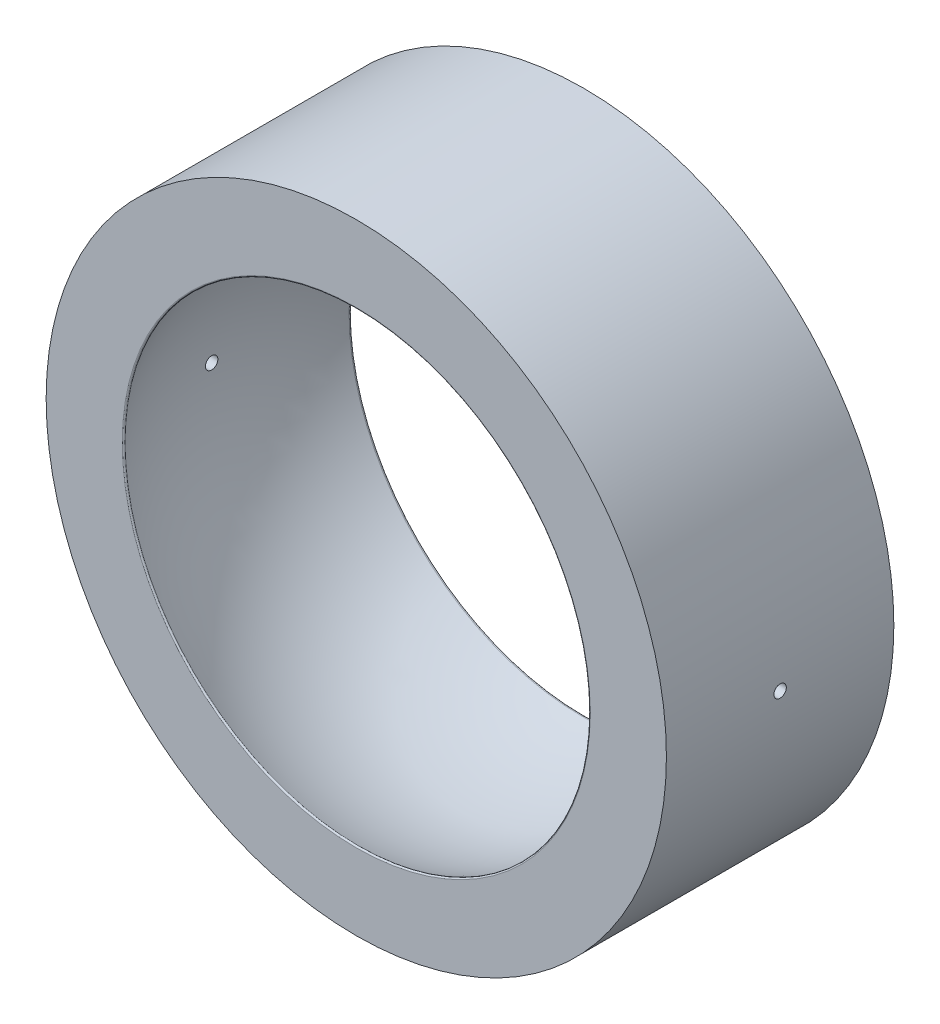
ISO-10303-21;
HEADER;
FILE_DESCRIPTION(('STEP AP214'),'2;1');
FILE_NAME('part.step','',(''),(''),'','','');
FILE_SCHEMA(('AUTOMOTIVE_DESIGN { 1 0 10303 214 1 1 1 1 }'));
ENDSEC;
DATA;
#1=APPLICATION_CONTEXT('core data for automotive mechanical design processes');
#2=APPLICATION_PROTOCOL_DEFINITION('international standard','automotive_design',2000,#1);
#3=PRODUCT_CONTEXT('',#1,'mechanical');
#4=PRODUCT('Part','Part','',(#3));
#5=PRODUCT_RELATED_PRODUCT_CATEGORY('part','',(#4));
#6=PRODUCT_DEFINITION_FORMATION('','',#4);
#7=PRODUCT_DEFINITION_CONTEXT('part definition',#1,'design');
#8=PRODUCT_DEFINITION('design','',#6,#7);
#9=PRODUCT_DEFINITION_SHAPE('','',#8);
#10=(LENGTH_UNIT() NAMED_UNIT(*) SI_UNIT(.MILLI.,.METRE.));
#11=(NAMED_UNIT(*) PLANE_ANGLE_UNIT() SI_UNIT($,.RADIAN.));
#12=(NAMED_UNIT(*) SI_UNIT($,.STERADIAN.) SOLID_ANGLE_UNIT());
#13=UNCERTAINTY_MEASURE_WITH_UNIT(LENGTH_MEASURE(1.E-05),#10,'distance_accuracy_value','');
#14=(GEOMETRIC_REPRESENTATION_CONTEXT(3) GLOBAL_UNCERTAINTY_ASSIGNED_CONTEXT((#13)) GLOBAL_UNIT_ASSIGNED_CONTEXT((#10,
#11,#12)) REPRESENTATION_CONTEXT('',''));
#15=CARTESIAN_POINT('',(0.,0.,0.));
#16=DIRECTION('',(0.,0.,1.));
#17=DIRECTION('',(1.,0.,0.));
#18=AXIS2_PLACEMENT_3D('',#15,#16,#17);
#19=CARTESIAN_POINT('',(69.,0.,0.));
#20=DIRECTION('',(0.,0.,-1.));
#21=DIRECTION('',(-1.,0.,0.));
#22=AXIS2_PLACEMENT_3D('',#19,#20,#21);
#23=DEGENERATE_TOROIDAL_SURFACE('',#22,0.0296511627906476,12.4703488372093,.T.);
#24=CARTESIAN_POINT('',(69.,0.,5.41395102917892));
#25=DIRECTION('',(0.,0.,-1.));
#26=DIRECTION('',(0.,1.,0.));
#27=AXIS2_PLACEMENT_3D('',#24,#25,#26);
#28=CIRCLE('',#27,11.2634721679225);
#29=CARTESIAN_POINT('',(69.,11.2634721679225,5.41395102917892));
#30=VERTEX_POINT('',#29);
#31=EDGE_CURVE('E34',#30,#30,#28,.T.);
#32=ORIENTED_EDGE('',*,*,#31,.F.);
#33=EDGE_LOOP('',(#32));
#34=FACE_BOUND('',#33,.T.);
#35=CARTESIAN_POINT('',(81.4963909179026,0.,-0.3));
#36=CARTESIAN_POINT('',(81.496390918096,0.0168414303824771,-0.299998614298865));
#37=CARTESIAN_POINT('',(81.496390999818,0.0336981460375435,-0.298576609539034));
#38=CARTESIAN_POINT('',(81.4963913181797,0.0669618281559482,-0.292919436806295));
#39=CARTESIAN_POINT('',(81.4963915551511,0.0833677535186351,-0.288678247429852));
#40=CARTESIAN_POINT('',(81.4963921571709,0.11522233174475,-0.277503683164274));
#41=CARTESIAN_POINT('',(81.4963925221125,0.130671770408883,-0.270572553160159));
#42=CARTESIAN_POINT('',(81.4963933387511,0.160179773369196,-0.254218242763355));
#43=CARTESIAN_POINT('',(81.4963937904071,0.174238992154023,-0.244796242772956));
#44=CARTESIAN_POINT('',(81.4963947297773,0.200579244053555,-0.223724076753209));
#45=CARTESIAN_POINT('',(81.4963952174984,0.212859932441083,-0.212073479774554));
#46=CARTESIAN_POINT('',(81.4963961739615,0.235292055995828,-0.186874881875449));
#47=CARTESIAN_POINT('',(81.4963966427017,0.245443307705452,-0.173326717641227));
#48=CARTESIAN_POINT('',(81.4963975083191,0.263326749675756,-0.144718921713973));
#49=CARTESIAN_POINT('',(81.496397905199,0.271059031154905,-0.129659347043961));
#50=CARTESIAN_POINT('',(81.4963985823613,0.283885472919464,-0.0984559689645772));
#51=CARTESIAN_POINT('',(81.4963988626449,0.288979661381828,-0.0823121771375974));
#52=CARTESIAN_POINT('',(81.4963992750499,0.296385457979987,-0.0493984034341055));
#53=CARTESIAN_POINT('',(81.4963994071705,0.298697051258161,-0.0326284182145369));
#54=CARTESIAN_POINT('',(81.4963995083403,0.300471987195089,0.00106161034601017));
#55=CARTESIAN_POINT('',(81.4963994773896,0.299935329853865,0.0179816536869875));
#56=CARTESIAN_POINT('',(81.4963992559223,0.296029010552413,0.0514913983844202));
#57=CARTESIAN_POINT('',(81.4963990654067,0.292659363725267,0.0680811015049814));
#58=CARTESIAN_POINT('',(81.4963985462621,0.283182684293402,0.10045950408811));
#59=CARTESIAN_POINT('',(81.4963982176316,0.277075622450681,0.116248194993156));
#60=CARTESIAN_POINT('',(81.4963974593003,0.262297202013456,0.146576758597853));
#61=CARTESIAN_POINT('',(81.4963970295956,0.253625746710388,0.161116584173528));
#62=CARTESIAN_POINT('',(81.4963961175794,0.233965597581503,0.188532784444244));
#63=CARTESIAN_POINT('',(81.4963956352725,0.222977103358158,0.201409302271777));
#64=CARTESIAN_POINT('',(81.4963946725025,0.1989968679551,0.225132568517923));
#65=CARTESIAN_POINT('',(81.4963941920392,0.186005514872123,0.235979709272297));
#66=CARTESIAN_POINT('',(81.4963932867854,0.158379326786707,0.255344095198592));
#67=CARTESIAN_POINT('',(81.4963928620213,0.1437437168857,0.263860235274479));
#68=CARTESIAN_POINT('',(81.4963921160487,0.113239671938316,0.278320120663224));
#69=CARTESIAN_POINT('',(81.4963917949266,0.0973702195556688,0.28426171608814));
#70=CARTESIAN_POINT('',(81.4963912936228,0.0648851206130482,0.293382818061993));
#71=CARTESIAN_POINT('',(81.496391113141,0.0482711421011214,0.296568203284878));
#72=CARTESIAN_POINT('',(81.4963909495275,0.0210523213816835,0.299446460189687));
#73=CARTESIAN_POINT('',(81.4963909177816,0.0105291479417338,0.300000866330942));
#74=CARTESIAN_POINT('',(81.496390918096,-0.0168414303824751,0.299998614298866));
#75=CARTESIAN_POINT('',(81.496390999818,-0.0336981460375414,0.298576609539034));
#76=CARTESIAN_POINT('',(81.4963913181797,-0.0669618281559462,0.292919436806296));
#77=CARTESIAN_POINT('',(81.4963915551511,-0.0833677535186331,0.288678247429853));
#78=CARTESIAN_POINT('',(81.4963921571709,-0.115222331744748,0.277503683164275));
#79=CARTESIAN_POINT('',(81.4963925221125,-0.130671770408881,0.270572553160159));
#80=CARTESIAN_POINT('',(81.4963933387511,-0.160179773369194,0.254218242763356));
#81=CARTESIAN_POINT('',(81.4963937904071,-0.174238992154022,0.244796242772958));
#82=CARTESIAN_POINT('',(81.4963947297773,-0.200579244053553,0.22372407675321));
#83=CARTESIAN_POINT('',(81.4963952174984,-0.212859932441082,0.212073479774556));
#84=CARTESIAN_POINT('',(81.4963961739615,-0.235292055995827,0.186874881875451));
#85=CARTESIAN_POINT('',(81.4963966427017,-0.245443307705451,0.173326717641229));
#86=CARTESIAN_POINT('',(81.4963975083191,-0.263326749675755,0.144718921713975));
#87=CARTESIAN_POINT('',(81.496397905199,-0.271059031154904,0.129659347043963));
#88=CARTESIAN_POINT('',(81.4963985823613,-0.283885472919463,0.0984559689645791));
#89=CARTESIAN_POINT('',(81.4963988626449,-0.288979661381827,0.0823121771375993));
#90=CARTESIAN_POINT('',(81.4963992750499,-0.296385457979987,0.0493984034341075));
#91=CARTESIAN_POINT('',(81.4963994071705,-0.298697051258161,0.0326284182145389));
#92=CARTESIAN_POINT('',(81.4963995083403,-0.300471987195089,-0.00106161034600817));
#93=CARTESIAN_POINT('',(81.4963994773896,-0.299935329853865,-0.0179816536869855));
#94=CARTESIAN_POINT('',(81.4963992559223,-0.296029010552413,-0.0514913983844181));
#95=CARTESIAN_POINT('',(81.4963990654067,-0.292659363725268,-0.0680811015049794));
#96=CARTESIAN_POINT('',(81.4963985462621,-0.283182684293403,-0.100459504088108));
#97=CARTESIAN_POINT('',(81.4963982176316,-0.277075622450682,-0.116248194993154));
#98=CARTESIAN_POINT('',(81.4963974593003,-0.262297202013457,-0.146576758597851));
#99=CARTESIAN_POINT('',(81.4963970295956,-0.253625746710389,-0.161116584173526));
#100=CARTESIAN_POINT('',(81.4963961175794,-0.233965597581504,-0.188532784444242));
#101=CARTESIAN_POINT('',(81.4963956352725,-0.22297710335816,-0.201409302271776));
#102=CARTESIAN_POINT('',(81.4963946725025,-0.198996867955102,-0.225132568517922));
#103=CARTESIAN_POINT('',(81.4963941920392,-0.186005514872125,-0.235979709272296));
#104=CARTESIAN_POINT('',(81.4963932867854,-0.158379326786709,-0.255344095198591));
#105=CARTESIAN_POINT('',(81.4963928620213,-0.143743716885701,-0.263860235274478));
#106=CARTESIAN_POINT('',(81.4963921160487,-0.113239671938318,-0.278320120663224));
#107=CARTESIAN_POINT('',(81.4963917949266,-0.0973702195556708,-0.28426171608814));
#108=CARTESIAN_POINT('',(81.4963912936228,-0.0648851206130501,-0.293382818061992));
#109=CARTESIAN_POINT('',(81.496391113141,-0.0482711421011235,-0.296568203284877));
#110=CARTESIAN_POINT('',(81.4963909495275,-0.0210523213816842,-0.299446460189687));
#111=CARTESIAN_POINT('',(81.4963909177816,-0.0105291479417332,-0.300000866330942));
#112=CARTESIAN_POINT('',(81.4963909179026,0.,-0.3));
#113=B_SPLINE_CURVE_WITH_KNOTS('',3,(#35,#36,#37,#38,#39,#40,#41,#42,#43,#44,#45,#46,#47,#48,
#49,#50,#51,#52,#53,#54,#55,#56,#57,#58,#59,#60,#61,#62,#63,#64,#65,#66,#67,#68,#69,#70,#71,#72,
#73,#74,#75,#76,#77,#78,#79,#80,#81,#82,#83,#84,#85,#86,#87,#88,#89,#90,#91,#92,#93,#94,#95,#96,
#97,#98,#99,#100,#101,#102,#103,#104,#105,#106,#107,#108,#109,#110,#111,#112),.UNSPECIFIED.,.T.,
.F.,(4,2,2,2,2,2,2,2,2,2,2,2,2,2,2,2,2,2,2,2,2,2,2,2,2,2,2,2,2,2,2,2,2,2,2,2,2,2,4),(0.,
0.0504912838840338,0.101090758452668,0.151648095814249,0.202181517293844,0.252724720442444,
0.303272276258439,0.353817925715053,0.404363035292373,0.454908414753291,0.505453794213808,
0.555998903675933,0.606544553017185,0.657092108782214,0.70763531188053,0.758168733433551,
0.808726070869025,0.859325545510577,0.909816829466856,0.941383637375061,0.991874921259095,
1.04247439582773,1.09303173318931,1.14356515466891,1.19410835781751,1.2446559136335,
1.29520156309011,1.34574667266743,1.39629205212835,1.44683743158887,1.49738254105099,
1.54792819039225,1.59847574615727,1.64901894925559,1.69955237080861,1.75010970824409,
1.80070918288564,1.85120046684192,1.88276727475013),.UNSPECIFIED.);
#114=CARTESIAN_POINT('',(81.4963909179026,0.,-0.3));
#115=VERTEX_POINT('',#114);
#116=EDGE_CURVE('E79',#115,#115,#113,.T.);
#117=ORIENTED_EDGE('',*,*,#116,.T.);
#118=EDGE_LOOP('',(#117));
#119=FACE_BOUND('',#118,.T.);
#120=CARTESIAN_POINT('',(69.,0.,-5.41395124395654));
#121=DIRECTION('',(0.,0.,1.));
#122=DIRECTION('',(0.,-1.,0.));
#123=AXIS2_PLACEMENT_3D('',#120,#121,#122);
#124=CIRCLE('',#123,11.263472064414);
#125=CARTESIAN_POINT('',(69.,-11.263472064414,-5.41395124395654));
#126=VERTEX_POINT('',#125);
#127=EDGE_CURVE('E75',#126,#126,#124,.T.);
#128=ORIENTED_EDGE('',*,*,#127,.F.);
#129=EDGE_LOOP('',(#128));
#130=FACE_BOUND('',#129,.T.);
#131=CARTESIAN_POINT('',(56.5036090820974,0.,0.3));
#132=CARTESIAN_POINT('',(56.503609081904,0.0168414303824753,0.299998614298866));
#133=CARTESIAN_POINT('',(56.503609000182,0.0336981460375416,0.298576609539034));
#134=CARTESIAN_POINT('',(56.5036086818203,0.0669618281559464,0.292919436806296));
#135=CARTESIAN_POINT('',(56.5036084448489,0.0833677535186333,0.288678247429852));
#136=CARTESIAN_POINT('',(56.5036078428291,0.115222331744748,0.277503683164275));
#137=CARTESIAN_POINT('',(56.5036074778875,0.130671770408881,0.270572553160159));
#138=CARTESIAN_POINT('',(56.5036066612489,0.160179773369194,0.254218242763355));
#139=CARTESIAN_POINT('',(56.5036062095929,0.174238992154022,0.244796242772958));
#140=CARTESIAN_POINT('',(56.5036052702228,0.200579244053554,0.22372407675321));
#141=CARTESIAN_POINT('',(56.5036047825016,0.212859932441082,0.212073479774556));
#142=CARTESIAN_POINT('',(56.5036038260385,0.235292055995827,0.186874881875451));
#143=CARTESIAN_POINT('',(56.5036033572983,0.245443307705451,0.173326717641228));
#144=CARTESIAN_POINT('',(56.5036024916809,0.263326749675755,0.144718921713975));
#145=CARTESIAN_POINT('',(56.503602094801,0.271059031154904,0.129659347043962));
#146=CARTESIAN_POINT('',(56.5036014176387,0.283885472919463,0.098455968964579));
#147=CARTESIAN_POINT('',(56.5036011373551,0.288979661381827,0.0823121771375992));
#148=CARTESIAN_POINT('',(56.5036007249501,0.296385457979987,0.0493984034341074));
#149=CARTESIAN_POINT('',(56.5036005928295,0.298697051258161,0.0326284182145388));
#150=CARTESIAN_POINT('',(56.5036004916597,0.300471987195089,-0.00106161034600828));
#151=CARTESIAN_POINT('',(56.5036005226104,0.299935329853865,-0.0179816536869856));
#152=CARTESIAN_POINT('',(56.5036007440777,0.296029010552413,-0.0514913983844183));
#153=CARTESIAN_POINT('',(56.5036009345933,0.292659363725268,-0.0680811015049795));
#154=CARTESIAN_POINT('',(56.503601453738,0.283182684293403,-0.100459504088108));
#155=CARTESIAN_POINT('',(56.5036017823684,0.277075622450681,-0.116248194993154));
#156=CARTESIAN_POINT('',(56.5036025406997,0.262297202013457,-0.146576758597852));
#157=CARTESIAN_POINT('',(56.5036029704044,0.253625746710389,-0.161116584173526));
#158=CARTESIAN_POINT('',(56.5036038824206,0.233965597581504,-0.188532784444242));
#159=CARTESIAN_POINT('',(56.5036043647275,0.222977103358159,-0.201409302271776));
#160=CARTESIAN_POINT('',(56.5036053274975,0.198996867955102,-0.225132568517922));
#161=CARTESIAN_POINT('',(56.5036058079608,0.186005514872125,-0.235979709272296));
#162=CARTESIAN_POINT('',(56.5036067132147,0.158379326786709,-0.255344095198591));
#163=CARTESIAN_POINT('',(56.5036071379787,0.143743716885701,-0.263860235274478));
#164=CARTESIAN_POINT('',(56.5036078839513,0.113239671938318,-0.278320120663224));
#165=CARTESIAN_POINT('',(56.5036082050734,0.0973702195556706,-0.28426171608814));
#166=CARTESIAN_POINT('',(56.5036087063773,0.06488512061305,-0.293382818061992));
#167=CARTESIAN_POINT('',(56.503608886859,0.0482711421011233,-0.296568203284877));
#168=CARTESIAN_POINT('',(56.5036090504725,0.0210523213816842,-0.299446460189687));
#169=CARTESIAN_POINT('',(56.5036090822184,0.0105291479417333,-0.300000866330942));
#170=CARTESIAN_POINT('',(56.503609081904,-0.0168414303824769,-0.299998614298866));
#171=CARTESIAN_POINT('',(56.503609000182,-0.0336981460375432,-0.298576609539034));
#172=CARTESIAN_POINT('',(56.5036086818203,-0.066961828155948,-0.292919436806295));
#173=CARTESIAN_POINT('',(56.5036084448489,-0.0833677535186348,-0.288678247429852));
#174=CARTESIAN_POINT('',(56.5036078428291,-0.11522233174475,-0.277503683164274));
#175=CARTESIAN_POINT('',(56.5036074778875,-0.130671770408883,-0.270572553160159));
#176=CARTESIAN_POINT('',(56.5036066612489,-0.160179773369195,-0.254218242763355));
#177=CARTESIAN_POINT('',(56.5036062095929,-0.174238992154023,-0.244796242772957));
#178=CARTESIAN_POINT('',(56.5036052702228,-0.200579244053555,-0.223724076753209));
#179=CARTESIAN_POINT('',(56.5036047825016,-0.212859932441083,-0.212073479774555));
#180=CARTESIAN_POINT('',(56.5036038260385,-0.235292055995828,-0.186874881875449));
#181=CARTESIAN_POINT('',(56.5036033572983,-0.245443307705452,-0.173326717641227));
#182=CARTESIAN_POINT('',(56.5036024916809,-0.263326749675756,-0.144718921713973));
#183=CARTESIAN_POINT('',(56.503602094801,-0.271059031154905,-0.129659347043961));
#184=CARTESIAN_POINT('',(56.5036014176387,-0.283885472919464,-0.0984559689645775));
#185=CARTESIAN_POINT('',(56.5036011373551,-0.288979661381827,-0.0823121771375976));
#186=CARTESIAN_POINT('',(56.5036007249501,-0.296385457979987,-0.0493984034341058));
#187=CARTESIAN_POINT('',(56.5036005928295,-0.298697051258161,-0.0326284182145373));
#188=CARTESIAN_POINT('',(56.5036004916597,-0.300471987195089,0.0010616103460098));
#189=CARTESIAN_POINT('',(56.5036005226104,-0.299935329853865,0.0179816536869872));
#190=CARTESIAN_POINT('',(56.5036007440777,-0.296029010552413,0.0514913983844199));
#191=CARTESIAN_POINT('',(56.5036009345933,-0.292659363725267,0.0680811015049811));
#192=CARTESIAN_POINT('',(56.503601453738,-0.283182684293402,0.100459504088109));
#193=CARTESIAN_POINT('',(56.5036017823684,-0.277075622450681,0.116248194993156));
#194=CARTESIAN_POINT('',(56.5036025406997,-0.262297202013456,0.146576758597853));
#195=CARTESIAN_POINT('',(56.5036029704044,-0.253625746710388,0.161116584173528));
#196=CARTESIAN_POINT('',(56.5036038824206,-0.233965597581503,0.188532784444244));
#197=CARTESIAN_POINT('',(56.5036043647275,-0.222977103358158,0.201409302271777));
#198=CARTESIAN_POINT('',(56.5036053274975,-0.198996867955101,0.225132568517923));
#199=CARTESIAN_POINT('',(56.5036058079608,-0.186005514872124,0.235979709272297));
#200=CARTESIAN_POINT('',(56.5036067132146,-0.158379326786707,0.255344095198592));
#201=CARTESIAN_POINT('',(56.5036071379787,-0.1437437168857,0.263860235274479));
#202=CARTESIAN_POINT('',(56.5036078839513,-0.113239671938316,0.278320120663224));
#203=CARTESIAN_POINT('',(56.5036082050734,-0.097370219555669,0.28426171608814));
#204=CARTESIAN_POINT('',(56.5036087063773,-0.0648851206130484,0.293382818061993));
#205=CARTESIAN_POINT('',(56.503608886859,-0.0482711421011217,0.296568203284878));
#206=CARTESIAN_POINT('',(56.5036090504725,-0.0210523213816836,0.299446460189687));
#207=CARTESIAN_POINT('',(56.5036090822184,-0.0105291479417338,0.300000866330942));
#208=CARTESIAN_POINT('',(56.5036090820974,0.,0.3));
#209=B_SPLINE_CURVE_WITH_KNOTS('',3,(#131,#132,#133,#134,#135,#136,#137,#138,#139,#140,#141,
#142,#143,#144,#145,#146,#147,#148,#149,#150,#151,#152,#153,#154,#155,#156,#157,#158,#159,#160,
#161,#162,#163,#164,#165,#166,#167,#168,#169,#170,#171,#172,#173,#174,#175,#176,#177,#178,#179,
#180,#181,#182,#183,#184,#185,#186,#187,#188,#189,#190,#191,#192,#193,#194,#195,#196,#197,#198,
#199,#200,#201,#202,#203,#204,#205,#206,#207,#208),.UNSPECIFIED.,.T.,.F.,(4,2,2,2,2,2,2,2,2,2,2,
2,2,2,2,2,2,2,2,2,2,2,2,2,2,2,2,2,2,2,2,2,2,2,2,2,2,2,4),(0.,0.0504912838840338,
0.101090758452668,0.151648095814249,0.202181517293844,0.252724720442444,0.303272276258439,
0.353817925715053,0.404363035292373,0.454908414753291,0.505453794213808,0.555998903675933,
0.606544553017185,0.657092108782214,0.70763531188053,0.75816873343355,0.808726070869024,
0.859325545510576,0.909816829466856,0.941383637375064,0.991874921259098,1.04247439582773,
1.09303173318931,1.14356515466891,1.19410835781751,1.2446559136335,1.29520156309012,
1.34574667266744,1.39629205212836,1.44683743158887,1.497382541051,1.54792819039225,
1.59847574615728,1.64901894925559,1.69955237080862,1.75010970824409,1.80070918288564,
1.85120046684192,1.88276727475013),.UNSPECIFIED.);
#210=CARTESIAN_POINT('',(56.5036090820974,0.,0.3));
#211=VERTEX_POINT('',#210);
#212=EDGE_CURVE('E18',#211,#211,#209,.T.);
#213=ORIENTED_EDGE('',*,*,#212,.T.);
#214=EDGE_LOOP('',(#213));
#215=FACE_BOUND('',#214,.T.);
#216=ADVANCED_FACE('F14',(#34,#119,#130,#215),#23,.F.);
#217=CARTESIAN_POINT('',(69.,0.,5.43999999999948));
#218=DIRECTION('',(0.,0.,-1.));
#219=DIRECTION('',(-1.,0.,0.));
#220=AXIS2_PLACEMENT_3D('',#217,#218,#219);
#221=TOROIDAL_SURFACE('',#220,11.3175226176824,0.06000000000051);
#222=CARTESIAN_POINT('',(69.,0.,5.49999999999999));
#223=DIRECTION('',(0.,0.,-1.));
#224=DIRECTION('',(-1.,0.,0.));
#225=AXIS2_PLACEMENT_3D('',#222,#223,#224);
#226=CIRCLE('',#225,11.3175226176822);
#227=CARTESIAN_POINT('',(57.6824773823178,0.,5.49999999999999));
#228=VERTEX_POINT('',#227);
#229=EDGE_CURVE('E72',#228,#228,#226,.T.);
#230=ORIENTED_EDGE('',*,*,#229,.F.);
#231=EDGE_LOOP('',(#230));
#232=FACE_BOUND('',#231,.T.);
#233=ORIENTED_EDGE('',*,*,#31,.T.);
#234=EDGE_LOOP('',(#233));
#235=FACE_BOUND('',#234,.T.);
#236=ADVANCED_FACE('F85',(#232,#235),#221,.T.);
#237=CARTESIAN_POINT('',(69.,0.,-5.44));
#238=DIRECTION('',(0.,0.,-1.));
#239=DIRECTION('',(0.,1.,0.));
#240=AXIS2_PLACEMENT_3D('',#237,#238,#239);
#241=TOROIDAL_SURFACE('',#240,11.3175226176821,0.0599999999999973);
#242=CARTESIAN_POINT('',(69.,0.,-5.5));
#243=DIRECTION('',(0.,0.,-1.));
#244=DIRECTION('',(0.,1.,0.));
#245=AXIS2_PLACEMENT_3D('',#242,#243,#244);
#246=CIRCLE('',#245,11.3175226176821);
#247=CARTESIAN_POINT('',(69.,11.3175226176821,-5.5));
#248=VERTEX_POINT('',#247);
#249=EDGE_CURVE('E74',#248,#248,#246,.F.);
#250=ORIENTED_EDGE('',*,*,#249,.F.);
#251=EDGE_LOOP('',(#250));
#252=FACE_BOUND('',#251,.T.);
#253=ORIENTED_EDGE('',*,*,#127,.T.);
#254=EDGE_LOOP('',(#253));
#255=FACE_BOUND('',#254,.T.);
#256=ADVANCED_FACE('F16',(#252,#255),#241,.T.);
#257=CARTESIAN_POINT('',(85.,0.,0.));
#258=DIRECTION('',(-1.,0.,0.));
#259=DIRECTION('',(0.,0.,1.));
#260=AXIS2_PLACEMENT_3D('',#257,#258,#259);
#261=CYLINDRICAL_SURFACE('',#260,0.3);
#262=CARTESIAN_POINT('',(54.,0.,0.3));
#263=CARTESIAN_POINT('',(54.0000000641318,-0.0168396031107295,0.299998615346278));
#264=CARTESIAN_POINT('',(54.0000286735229,-0.0336944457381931,0.298576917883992));
#265=CARTESIAN_POINT('',(54.000140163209,-0.0669543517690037,0.292921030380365));
#266=CARTESIAN_POINT('',(54.0002231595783,-0.0833583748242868,0.288680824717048));
#267=CARTESIAN_POINT('',(54.000433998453,-0.115209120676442,0.277509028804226));
#268=CARTESIAN_POINT('',(54.000561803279,-0.130656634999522,0.270579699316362));
#269=CARTESIAN_POINT('',(54.0008478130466,-0.160161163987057,0.254229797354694));
#270=CARTESIAN_POINT('',(54.0010060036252,-0.174218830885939,0.244810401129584));
#271=CARTESIAN_POINT('',(54.0013350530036,-0.200558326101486,0.223742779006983));
#272=CARTESIAN_POINT('',(54.0015059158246,-0.212839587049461,0.212093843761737));
#273=CARTESIAN_POINT('',(54.0018410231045,-0.235273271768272,0.186898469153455));
#274=CARTESIAN_POINT('',(54.0020052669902,-0.245425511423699,0.173351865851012));
#275=CARTESIAN_POINT('',(54.0023086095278,-0.263312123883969,0.144745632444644));
#276=CARTESIAN_POINT('',(54.0024477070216,-0.271046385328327,0.129685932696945));
#277=CARTESIAN_POINT('',(54.0026850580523,-0.283876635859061,0.0984816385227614));
#278=CARTESIAN_POINT('',(54.0027833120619,-0.288972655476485,0.0823370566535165));
#279=CARTESIAN_POINT('',(54.0029278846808,-0.296381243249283,0.0494233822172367));
#280=CARTESIAN_POINT('',(54.002974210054,-0.298694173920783,0.0326543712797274));
#281=CARTESIAN_POINT('',(54.0030097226,-0.300472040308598,-0.00103400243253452));
#282=CARTESIAN_POINT('',(54.0029989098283,-0.299936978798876,-0.0179533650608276));
#283=CARTESIAN_POINT('',(54.0029213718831,-0.296034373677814,-0.0514595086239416));
#284=CARTESIAN_POINT('',(54.0028546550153,-0.292667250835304,-0.0680463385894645));
#285=CARTESIAN_POINT('',(54.0026728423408,-0.283196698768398,-0.100419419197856));
#286=CARTESIAN_POINT('',(54.0025577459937,-0.277093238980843,-0.116205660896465));
#287=CARTESIAN_POINT('',(54.0022921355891,-0.262322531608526,-0.146531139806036));
#288=CARTESIAN_POINT('',(54.0021416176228,-0.253655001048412,-0.161070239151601));
#289=CARTESIAN_POINT('',(54.0018221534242,-0.234003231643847,-0.188485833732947));
#290=CARTESIAN_POINT('',(54.0016532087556,-0.223019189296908,-0.201362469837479));
#291=CARTESIAN_POINT('',(54.0013159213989,-0.199045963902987,-0.225089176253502));
#292=CARTESIAN_POINT('',(54.0011475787,-0.186056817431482,-0.235939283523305));
#293=CARTESIAN_POINT('',(54.0008303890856,-0.158434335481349,-0.255309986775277));
#294=CARTESIAN_POINT('',(54.0006815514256,-0.143800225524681,-0.263829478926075));
#295=CARTESIAN_POINT('',(54.000420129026,-0.113298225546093,-0.278296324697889));
#296=CARTESIAN_POINT('',(54.0003075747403,-0.0974293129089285,-0.284241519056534));
#297=CARTESIAN_POINT('',(54.0001318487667,-0.0649444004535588,-0.293369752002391));
#298=CARTESIAN_POINT('',(54.0000685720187,-0.0483300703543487,-0.296558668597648));
#299=CARTESIAN_POINT('',(54.000011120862,-0.0210913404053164,-0.299444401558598));
#300=CARTESIAN_POINT('',(53.9999999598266,-0.0105486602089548,-0.300000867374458));
#301=CARTESIAN_POINT('',(54.0000000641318,0.0168396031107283,-0.299998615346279));
#302=CARTESIAN_POINT('',(54.0000286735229,0.0336944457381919,-0.298576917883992));
#303=CARTESIAN_POINT('',(54.000140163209,0.0669543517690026,-0.292921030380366));
#304=CARTESIAN_POINT('',(54.0002231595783,0.0833583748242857,-0.288680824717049));
#305=CARTESIAN_POINT('',(54.000433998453,0.115209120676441,-0.277509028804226));
#306=CARTESIAN_POINT('',(54.000561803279,0.130656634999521,-0.270579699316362));
#307=CARTESIAN_POINT('',(54.0008478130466,0.160161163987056,-0.254229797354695));
#308=CARTESIAN_POINT('',(54.0010060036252,0.174218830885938,-0.244810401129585));
#309=CARTESIAN_POINT('',(54.0013350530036,0.200558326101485,-0.223742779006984));
#310=CARTESIAN_POINT('',(54.0015059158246,0.212839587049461,-0.212093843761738));
#311=CARTESIAN_POINT('',(54.0018410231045,0.235273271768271,-0.186898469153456));
#312=CARTESIAN_POINT('',(54.0020052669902,0.245425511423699,-0.173351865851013));
#313=CARTESIAN_POINT('',(54.0023086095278,0.263312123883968,-0.144745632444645));
#314=CARTESIAN_POINT('',(54.0024477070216,0.271046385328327,-0.129685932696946));
#315=CARTESIAN_POINT('',(54.0026850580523,0.283876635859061,-0.0984816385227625));
#316=CARTESIAN_POINT('',(54.0027833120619,0.288972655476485,-0.0823370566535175));
#317=CARTESIAN_POINT('',(54.0029278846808,0.296381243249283,-0.0494233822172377));
#318=CARTESIAN_POINT('',(54.002974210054,0.298694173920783,-0.0326543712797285));
#319=CARTESIAN_POINT('',(54.0030097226,0.300472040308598,0.0010340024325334));
#320=CARTESIAN_POINT('',(54.0029989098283,0.299936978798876,0.0179533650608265));
#321=CARTESIAN_POINT('',(54.0029213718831,0.296034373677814,0.0514595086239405));
#322=CARTESIAN_POINT('',(54.0028546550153,0.292667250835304,0.0680463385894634));
#323=CARTESIAN_POINT('',(54.0026728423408,0.283196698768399,0.100419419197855));
#324=CARTESIAN_POINT('',(54.0025577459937,0.277093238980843,0.116205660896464));
#325=CARTESIAN_POINT('',(54.0022921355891,0.262322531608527,0.146531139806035));
#326=CARTESIAN_POINT('',(54.0021416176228,0.253655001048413,0.1610702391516));
#327=CARTESIAN_POINT('',(54.0018221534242,0.234003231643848,0.188485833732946));
#328=CARTESIAN_POINT('',(54.0016532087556,0.223019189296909,0.201362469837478));
#329=CARTESIAN_POINT('',(54.0013159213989,0.199045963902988,0.225089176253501));
#330=CARTESIAN_POINT('',(54.0011475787,0.186056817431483,0.235939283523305));
#331=CARTESIAN_POINT('',(54.0008303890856,0.15843433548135,0.255309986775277));
#332=CARTESIAN_POINT('',(54.0006815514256,0.143800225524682,0.263829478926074));
#333=CARTESIAN_POINT('',(54.000420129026,0.113298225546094,0.278296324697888));
#334=CARTESIAN_POINT('',(54.0003075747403,0.0974293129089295,0.284241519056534));
#335=CARTESIAN_POINT('',(54.0001318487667,0.0649444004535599,0.29336975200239));
#336=CARTESIAN_POINT('',(54.0000685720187,0.0483300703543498,0.296558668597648));
#337=CARTESIAN_POINT('',(54.000011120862,0.0210913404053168,0.299444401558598));
#338=CARTESIAN_POINT('',(53.9999999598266,0.0105486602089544,0.300000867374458));
#339=CARTESIAN_POINT('',(54.,0.,0.3));
#340=B_SPLINE_CURVE_WITH_KNOTS('',3,(#262,#263,#264,#265,#266,#267,#268,#269,#270,#271,#272,
#273,#274,#275,#276,#277,#278,#279,#280,#281,#282,#283,#284,#285,#286,#287,#288,#289,#290,#291,
#292,#293,#294,#295,#296,#297,#298,#299,#300,#301,#302,#303,#304,#305,#306,#307,#308,#309,#310,
#311,#312,#313,#314,#315,#316,#317,#318,#319,#320,#321,#322,#323,#324,#325,#326,#327,#328,#329,
#330,#331,#332,#333,#334,#335,#336,#337,#338,#339),.UNSPECIFIED.,.T.,.F.,(4,2,2,2,2,2,2,2,2,2,2,
2,2,2,2,2,2,2,2,2,2,2,2,2,2,2,2,2,2,2,2,2,2,2,2,2,2,2,4),(0.,0.0504857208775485,
0.101079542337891,0.15163092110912,0.202158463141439,0.252702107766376,0.303250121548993,
0.353800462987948,0.404350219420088,0.454893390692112,0.505436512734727,0.555972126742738,
0.606508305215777,0.657050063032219,0.70758753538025,0.758124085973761,0.808684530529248,
0.859287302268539,0.909781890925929,0.941407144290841,0.99189286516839,1.04248668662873,
1.09303806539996,1.14356560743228,1.19410925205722,1.24465726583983,1.29520760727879,
1.34575736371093,1.39630053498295,1.44684365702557,1.49737927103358,1.54791544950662,
1.59845720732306,1.64899467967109,1.6995312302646,1.75009167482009,1.80069444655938,
1.85118903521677,1.88281428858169),.UNSPECIFIED.);
#341=CARTESIAN_POINT('',(54.,0.,0.3));
#342=VERTEX_POINT('',#341);
#343=EDGE_CURVE('E43',#342,#342,#340,.T.);
#344=ORIENTED_EDGE('',*,*,#343,.F.);
#345=EDGE_LOOP('',(#344));
#346=FACE_BOUND('',#345,.T.);
#347=ORIENTED_EDGE('',*,*,#212,.F.);
#348=EDGE_LOOP('',(#347));
#349=FACE_BOUND('',#348,.T.);
#350=ADVANCED_FACE('F66',(#346,#349),#261,.F.);
#351=CARTESIAN_POINT('',(85.,0.,0.));
#352=DIRECTION('',(-1.,0.,0.));
#353=DIRECTION('',(0.,0.,1.));
#354=AXIS2_PLACEMENT_3D('',#351,#352,#353);
#355=CYLINDRICAL_SURFACE('',#354,0.3);
#356=ORIENTED_EDGE('',*,*,#116,.F.);
#357=EDGE_LOOP('',(#356));
#358=FACE_BOUND('',#357,.T.);
#359=CARTESIAN_POINT('',(84.,0.,-0.3));
#360=CARTESIAN_POINT('',(83.9999999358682,-0.016839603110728,-0.299998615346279));
#361=CARTESIAN_POINT('',(83.9999713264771,-0.0336944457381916,-0.298576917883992));
#362=CARTESIAN_POINT('',(83.999859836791,-0.0669543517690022,-0.292921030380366));
#363=CARTESIAN_POINT('',(83.9997768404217,-0.0833583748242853,-0.288680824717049));
#364=CARTESIAN_POINT('',(83.999566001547,-0.115209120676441,-0.277509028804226));
#365=CARTESIAN_POINT('',(83.9994381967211,-0.130656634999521,-0.270579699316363));
#366=CARTESIAN_POINT('',(83.9991521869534,-0.160161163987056,-0.254229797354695));
#367=CARTESIAN_POINT('',(83.9989939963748,-0.174218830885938,-0.244810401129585));
#368=CARTESIAN_POINT('',(83.9986649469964,-0.200558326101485,-0.223742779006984));
#369=CARTESIAN_POINT('',(83.9984940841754,-0.21283958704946,-0.212093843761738));
#370=CARTESIAN_POINT('',(83.9981589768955,-0.235273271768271,-0.186898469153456));
#371=CARTESIAN_POINT('',(83.9979947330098,-0.245425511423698,-0.173351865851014));
#372=CARTESIAN_POINT('',(83.9976913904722,-0.263312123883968,-0.144745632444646));
#373=CARTESIAN_POINT('',(83.9975522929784,-0.271046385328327,-0.129685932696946));
#374=CARTESIAN_POINT('',(83.9973149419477,-0.283876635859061,-0.0984816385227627));
#375=CARTESIAN_POINT('',(83.9972166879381,-0.288972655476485,-0.0823370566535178));
#376=CARTESIAN_POINT('',(83.9970721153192,-0.296381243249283,-0.049423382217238));
#377=CARTESIAN_POINT('',(83.997025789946,-0.298694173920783,-0.0326543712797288));
#378=CARTESIAN_POINT('',(83.9969902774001,-0.300472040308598,0.00103400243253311));
#379=CARTESIAN_POINT('',(83.9970010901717,-0.299936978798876,0.0179533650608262));
#380=CARTESIAN_POINT('',(83.9970786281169,-0.296034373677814,0.0514595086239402));
#381=CARTESIAN_POINT('',(83.9971453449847,-0.292667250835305,0.0680463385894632));
#382=CARTESIAN_POINT('',(83.9973271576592,-0.283196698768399,0.100419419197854));
#383=CARTESIAN_POINT('',(83.9974422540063,-0.277093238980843,0.116205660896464));
#384=CARTESIAN_POINT('',(83.9977078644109,-0.262322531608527,0.146531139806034));
#385=CARTESIAN_POINT('',(83.9978583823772,-0.253655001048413,0.1610702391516));
#386=CARTESIAN_POINT('',(83.9981778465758,-0.234003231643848,0.188485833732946));
#387=CARTESIAN_POINT('',(83.9983467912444,-0.223019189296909,0.201362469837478));
#388=CARTESIAN_POINT('',(83.9986840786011,-0.199045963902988,0.225089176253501));
#389=CARTESIAN_POINT('',(83.9988524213,-0.186056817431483,0.235939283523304));
#390=CARTESIAN_POINT('',(83.9991696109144,-0.15843433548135,0.255309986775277));
#391=CARTESIAN_POINT('',(83.9993184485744,-0.143800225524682,0.263829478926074));
#392=CARTESIAN_POINT('',(83.9995798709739,-0.113298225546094,0.278296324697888));
#393=CARTESIAN_POINT('',(83.9996924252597,-0.0974293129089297,0.284241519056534));
#394=CARTESIAN_POINT('',(83.9998681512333,-0.06494440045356,0.29336975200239));
#395=CARTESIAN_POINT('',(83.9999314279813,-0.0483300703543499,0.296558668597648));
#396=CARTESIAN_POINT('',(83.999988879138,-0.0210913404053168,0.299444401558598));
#397=CARTESIAN_POINT('',(84.0000000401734,-0.0105486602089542,0.300000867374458));
#398=CARTESIAN_POINT('',(83.9999999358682,0.0168396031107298,0.299998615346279));
#399=CARTESIAN_POINT('',(83.9999713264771,0.0336944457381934,0.298576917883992));
#400=CARTESIAN_POINT('',(83.999859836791,0.0669543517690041,0.292921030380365));
#401=CARTESIAN_POINT('',(83.9997768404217,0.0833583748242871,0.288680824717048));
#402=CARTESIAN_POINT('',(83.999566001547,0.115209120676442,0.277509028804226));
#403=CARTESIAN_POINT('',(83.9994381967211,0.130656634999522,0.270579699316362));
#404=CARTESIAN_POINT('',(83.9991521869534,0.160161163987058,0.254229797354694));
#405=CARTESIAN_POINT('',(83.9989939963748,0.174218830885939,0.244810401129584));
#406=CARTESIAN_POINT('',(83.9986649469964,0.200558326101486,0.223742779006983));
#407=CARTESIAN_POINT('',(83.9984940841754,0.212839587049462,0.212093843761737));
#408=CARTESIAN_POINT('',(83.9981589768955,0.235273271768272,0.186898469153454));
#409=CARTESIAN_POINT('',(83.9979947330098,0.245425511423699,0.173351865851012));
#410=CARTESIAN_POINT('',(83.9976913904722,0.263312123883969,0.144745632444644));
#411=CARTESIAN_POINT('',(83.9975522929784,0.271046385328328,0.129685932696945));
#412=CARTESIAN_POINT('',(83.9973149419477,0.283876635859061,0.0984816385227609));
#413=CARTESIAN_POINT('',(83.9972166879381,0.288972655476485,0.082337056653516));
#414=CARTESIAN_POINT('',(83.9970721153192,0.296381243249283,0.0494233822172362));
#415=CARTESIAN_POINT('',(83.997025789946,0.298694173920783,0.032654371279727));
#416=CARTESIAN_POINT('',(83.9969902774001,0.300472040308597,-0.00103400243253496));
#417=CARTESIAN_POINT('',(83.9970010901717,0.299936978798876,-0.017953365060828));
#418=CARTESIAN_POINT('',(83.9970786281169,0.296034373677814,-0.051459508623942));
#419=CARTESIAN_POINT('',(83.9971453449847,0.292667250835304,-0.0680463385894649));
#420=CARTESIAN_POINT('',(83.9973271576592,0.283196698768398,-0.100419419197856));
#421=CARTESIAN_POINT('',(83.9974422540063,0.277093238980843,-0.116205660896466));
#422=CARTESIAN_POINT('',(83.9977078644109,0.262322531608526,-0.146531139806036));
#423=CARTESIAN_POINT('',(83.9978583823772,0.253655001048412,-0.161070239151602));
#424=CARTESIAN_POINT('',(83.9981778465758,0.234003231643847,-0.188485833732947));
#425=CARTESIAN_POINT('',(83.9983467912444,0.223019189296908,-0.201362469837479));
#426=CARTESIAN_POINT('',(83.9986840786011,0.199045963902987,-0.225089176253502));
#427=CARTESIAN_POINT('',(83.9988524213,0.186056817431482,-0.235939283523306));
#428=CARTESIAN_POINT('',(83.9991696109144,0.158434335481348,-0.255309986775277));
#429=CARTESIAN_POINT('',(83.9993184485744,0.14380022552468,-0.263829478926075));
#430=CARTESIAN_POINT('',(83.9995798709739,0.113298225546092,-0.278296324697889));
#431=CARTESIAN_POINT('',(83.9996924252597,0.0974293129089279,-0.284241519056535));
#432=CARTESIAN_POINT('',(83.9998681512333,0.0649444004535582,-0.293369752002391));
#433=CARTESIAN_POINT('',(83.9999314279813,0.0483300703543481,-0.296558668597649));
#434=CARTESIAN_POINT('',(83.999988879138,0.0210913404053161,-0.299444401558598));
#435=CARTESIAN_POINT('',(84.0000000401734,0.0105486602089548,-0.300000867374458));
#436=CARTESIAN_POINT('',(84.,0.,-0.3));
#437=B_SPLINE_CURVE_WITH_KNOTS('',3,(#359,#360,#361,#362,#363,#364,#365,#366,#367,#368,#369,
#370,#371,#372,#373,#374,#375,#376,#377,#378,#379,#380,#381,#382,#383,#384,#385,#386,#387,#388,
#389,#390,#391,#392,#393,#394,#395,#396,#397,#398,#399,#400,#401,#402,#403,#404,#405,#406,#407,
#408,#409,#410,#411,#412,#413,#414,#415,#416,#417,#418,#419,#420,#421,#422,#423,#424,#425,#426,
#427,#428,#429,#430,#431,#432,#433,#434,#435,#436),.UNSPECIFIED.,.T.,.F.,(4,2,2,2,2,2,2,2,2,2,2,
2,2,2,2,2,2,2,2,2,2,2,2,2,2,2,2,2,2,2,2,2,2,2,2,2,2,2,4),(0.,0.0504857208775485,
0.101079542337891,0.15163092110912,0.202158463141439,0.252702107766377,0.303250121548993,
0.353800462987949,0.404350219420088,0.454893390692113,0.505436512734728,0.555972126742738,
0.606508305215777,0.657050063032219,0.70758753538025,0.758124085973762,0.808684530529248,
0.859287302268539,0.90978189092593,0.941407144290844,0.991892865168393,1.04248668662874,
1.09303806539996,1.14356560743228,1.19410925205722,1.24465726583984,1.29520760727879,
1.34575736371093,1.39630053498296,1.44684365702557,1.49737927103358,1.54791544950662,
1.59845720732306,1.64899467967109,1.69953123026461,1.75009167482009,1.80069444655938,
1.85118903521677,1.88281428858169),.UNSPECIFIED.);
#438=CARTESIAN_POINT('',(84.,0.,-0.3));
#439=VERTEX_POINT('',#438);
#440=EDGE_CURVE('E31',#439,#439,#437,.T.);
#441=ORIENTED_EDGE('',*,*,#440,.F.);
#442=EDGE_LOOP('',(#441));
#443=FACE_BOUND('',#442,.T.);
#444=ADVANCED_FACE('F47',(#358,#443),#355,.F.);
#445=CARTESIAN_POINT('',(69.,-13.1587613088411,5.5));
#446=DIRECTION('',(0.,0.,1.));
#447=DIRECTION('',(1.,0.,0.));
#448=AXIS2_PLACEMENT_3D('',#445,#446,#447);
#449=PLANE('',#448);
#450=CARTESIAN_POINT('',(69.,0.,5.5));
#451=DIRECTION('',(0.,0.,-1.));
#452=DIRECTION('',(-1.,0.,0.));
#453=AXIS2_PLACEMENT_3D('',#450,#451,#452);
#454=CIRCLE('',#453,15.);
#455=CARTESIAN_POINT('',(54.,0.,5.5));
#456=VERTEX_POINT('',#455);
#457=EDGE_CURVE('E26',#456,#456,#454,.T.);
#458=ORIENTED_EDGE('',*,*,#457,.F.);
#459=EDGE_LOOP('',(#458));
#460=FACE_BOUND('',#459,.T.);
#461=ORIENTED_EDGE('',*,*,#229,.T.);
#462=EDGE_LOOP('',(#461));
#463=FACE_BOUND('',#462,.T.);
#464=ADVANCED_FACE('F58',(#460,#463),#449,.T.);
#465=CARTESIAN_POINT('',(69.,-13.1587613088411,-5.5));
#466=DIRECTION('',(0.,0.,-1.));
#467=DIRECTION('',(-1.,0.,0.));
#468=AXIS2_PLACEMENT_3D('',#465,#466,#467);
#469=PLANE('',#468);
#470=CARTESIAN_POINT('',(69.,0.,-5.5));
#471=DIRECTION('',(0.,0.,-1.));
#472=DIRECTION('',(-1.,0.,0.));
#473=AXIS2_PLACEMENT_3D('',#470,#471,#472);
#474=CIRCLE('',#473,15.);
#475=CARTESIAN_POINT('',(54.,0.,-5.5));
#476=VERTEX_POINT('',#475);
#477=EDGE_CURVE('E10',#476,#476,#474,.F.);
#478=ORIENTED_EDGE('',*,*,#477,.F.);
#479=EDGE_LOOP('',(#478));
#480=FACE_BOUND('',#479,.T.);
#481=ORIENTED_EDGE('',*,*,#249,.T.);
#482=EDGE_LOOP('',(#481));
#483=FACE_BOUND('',#482,.T.);
#484=ADVANCED_FACE('F54',(#480,#483),#469,.T.);
#485=CARTESIAN_POINT('',(69.,0.,0.));
#486=DIRECTION('',(0.,0.,-1.));
#487=DIRECTION('',(-1.,0.,0.));
#488=AXIS2_PLACEMENT_3D('',#485,#486,#487);
#489=CYLINDRICAL_SURFACE('',#488,15.);
#490=ORIENTED_EDGE('',*,*,#440,.T.);
#491=EDGE_LOOP('',(#490));
#492=FACE_BOUND('',#491,.T.);
#493=ORIENTED_EDGE('',*,*,#477,.T.);
#494=EDGE_LOOP('',(#493));
#495=FACE_BOUND('',#494,.T.);
#496=ORIENTED_EDGE('',*,*,#343,.T.);
#497=EDGE_LOOP('',(#496));
#498=FACE_BOUND('',#497,.T.);
#499=ORIENTED_EDGE('',*,*,#457,.T.);
#500=EDGE_LOOP('',(#499));
#501=FACE_BOUND('',#500,.T.);
#502=ADVANCED_FACE('F50',(#492,#495,#498,#501),#489,.T.);
#503=CLOSED_SHELL('',(#216,#236,#256,#350,#444,#464,#484,#502));
#504=MANIFOLD_SOLID_BREP('B1',#503);
#505=ADVANCED_BREP_SHAPE_REPRESENTATION('',(#18,#504),#14);
#506=SHAPE_DEFINITION_REPRESENTATION(#9,#505);
ENDSEC;
END-ISO-10303-21;
